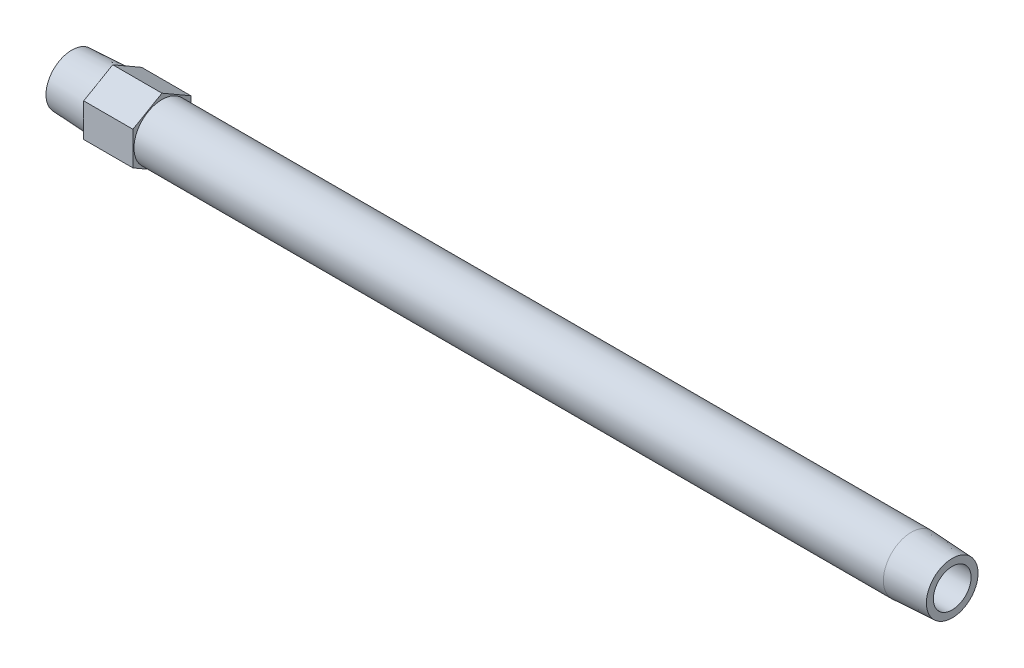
ISO-10303-21;
HEADER;
FILE_DESCRIPTION(('STEP AP214'),'2;1');
FILE_NAME('part.step','',(''),(''),'','','');
FILE_SCHEMA(('AUTOMOTIVE_DESIGN { 1 0 10303 214 1 1 1 1 }'));
ENDSEC;
DATA;
#1=APPLICATION_CONTEXT('core data for automotive mechanical design processes');
#2=APPLICATION_PROTOCOL_DEFINITION('international standard','automotive_design',2000,#1);
#3=PRODUCT_CONTEXT('',#1,'mechanical');
#4=PRODUCT('Part','Part','',(#3));
#5=PRODUCT_RELATED_PRODUCT_CATEGORY('part','',(#4));
#6=PRODUCT_DEFINITION_FORMATION('','',#4);
#7=PRODUCT_DEFINITION_CONTEXT('part definition',#1,'design');
#8=PRODUCT_DEFINITION('design','',#6,#7);
#9=PRODUCT_DEFINITION_SHAPE('','',#8);
#10=(LENGTH_UNIT() NAMED_UNIT(*) SI_UNIT(.MILLI.,.METRE.));
#11=(NAMED_UNIT(*) PLANE_ANGLE_UNIT() SI_UNIT($,.RADIAN.));
#12=(NAMED_UNIT(*) SI_UNIT($,.STERADIAN.) SOLID_ANGLE_UNIT());
#13=UNCERTAINTY_MEASURE_WITH_UNIT(LENGTH_MEASURE(1.E-05),#10,'distance_accuracy_value','');
#14=(GEOMETRIC_REPRESENTATION_CONTEXT(3) GLOBAL_UNCERTAINTY_ASSIGNED_CONTEXT((#13)) GLOBAL_UNIT_ASSIGNED_CONTEXT((#10,
#11,#12)) REPRESENTATION_CONTEXT('',''));
#15=CARTESIAN_POINT('',(0.,0.,0.));
#16=DIRECTION('',(0.,0.,1.));
#17=DIRECTION('',(1.,0.,0.));
#18=AXIS2_PLACEMENT_3D('',#15,#16,#17);
#19=CARTESIAN_POINT('',(0.,0.,-6.3321927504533));
#20=DIRECTION('',(1.,0.,0.));
#21=DIRECTION('',(0.,0.,-1.));
#22=AXIS2_PLACEMENT_3D('',#19,#20,#21);
#23=PLANE('',#22);
#24=CARTESIAN_POINT('',(0.,0.,0.));
#25=DIRECTION('',(-1.,0.,0.));
#26=DIRECTION('',(0.,0.,1.));
#27=AXIS2_PLACEMENT_3D('',#24,#25,#26);
#28=CIRCLE('',#27,6.3321927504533);
#29=CARTESIAN_POINT('',(0.,0.,6.3321927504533));
#30=VERTEX_POINT('',#29);
#31=EDGE_CURVE('E147',#30,#30,#28,.T.);
#32=ORIENTED_EDGE('',*,*,#31,.T.);
#33=EDGE_LOOP('',(#32));
#34=FACE_BOUND('',#33,.T.);
#35=CARTESIAN_POINT('',(0.,0.,0.));
#36=DIRECTION('',(1.,0.,0.));
#37=DIRECTION('',(0.,0.,1.));
#38=AXIS2_PLACEMENT_3D('',#35,#36,#37);
#39=CIRCLE('',#38,4.6228);
#40=CARTESIAN_POINT('',(0.,0.,4.6228));
#41=VERTEX_POINT('',#40);
#42=EDGE_CURVE('E159',#41,#41,#39,.T.);
#43=ORIENTED_EDGE('',*,*,#42,.T.);
#44=EDGE_LOOP('',(#43));
#45=FACE_BOUND('',#44,.T.);
#46=ADVANCED_FACE('F15',(#34,#45),#23,.F.);
#47=CARTESIAN_POINT('',(215.9,0.,-6.33219275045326));
#48=DIRECTION('',(-1.,0.,0.));
#49=DIRECTION('',(0.,0.,1.));
#50=AXIS2_PLACEMENT_3D('',#47,#48,#49);
#51=PLANE('',#50);
#52=CARTESIAN_POINT('',(215.9,0.,0.));
#53=DIRECTION('',(-1.,0.,0.));
#54=DIRECTION('',(0.,0.,1.));
#55=AXIS2_PLACEMENT_3D('',#52,#53,#54);
#56=CIRCLE('',#55,6.33219275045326);
#57=CARTESIAN_POINT('',(215.9,0.,6.33219275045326));
#58=VERTEX_POINT('',#57);
#59=EDGE_CURVE('E150',#58,#58,#56,.T.);
#60=ORIENTED_EDGE('',*,*,#59,.F.);
#61=EDGE_LOOP('',(#60));
#62=FACE_BOUND('',#61,.T.);
#63=CARTESIAN_POINT('',(215.9,0.,0.));
#64=DIRECTION('',(-1.,0.,0.));
#65=DIRECTION('',(0.,0.,1.));
#66=AXIS2_PLACEMENT_3D('',#63,#64,#65);
#67=CIRCLE('',#66,4.6228);
#68=CARTESIAN_POINT('',(215.9,0.,4.6228));
#69=VERTEX_POINT('',#68);
#70=EDGE_CURVE('E156',#69,#69,#67,.F.);
#71=ORIENTED_EDGE('',*,*,#70,.F.);
#72=EDGE_LOOP('',(#71));
#73=FACE_BOUND('',#72,.T.);
#74=ADVANCED_FACE('F178',(#62,#73),#51,.F.);
#75=CARTESIAN_POINT('',(22.098,-12.3183453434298,7.112));
#76=DIRECTION('',(-1.,0.,0.));
#77=DIRECTION('',(0.,-1.,0.));
#78=AXIS2_PLACEMENT_3D('',#75,#76,#77);
#79=PLANE('',#78);
#80=DIRECTION('',(0.,0.5,-0.866025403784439));
#81=VECTOR('',#80,1.);
#82=CARTESIAN_POINT('',(22.098,-8.21223022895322,0.));
#83=LINE('',#82,#81);
#84=CARTESIAN_POINT('',(22.098,-8.21223022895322,0.));
#85=VERTEX_POINT('',#84);
#86=CARTESIAN_POINT('',(22.098,-4.10611511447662,-7.112));
#87=VERTEX_POINT('',#86);
#88=EDGE_CURVE('E103',#85,#87,#83,.T.);
#89=ORIENTED_EDGE('',*,*,#88,.T.);
#90=DIRECTION('',(0.,1.,0.));
#91=VECTOR('',#90,1.);
#92=CARTESIAN_POINT('',(22.098,-4.10611511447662,-7.112));
#93=LINE('',#92,#91);
#94=CARTESIAN_POINT('',(22.098,4.10611511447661,-7.112));
#95=VERTEX_POINT('',#94);
#96=EDGE_CURVE('E83',#87,#95,#93,.T.);
#97=ORIENTED_EDGE('',*,*,#96,.T.);
#98=DIRECTION('',(0.,0.5,0.866025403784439));
#99=VECTOR('',#98,1.);
#100=CARTESIAN_POINT('',(22.098,4.10611511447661,-7.112));
#101=LINE('',#100,#99);
#102=CARTESIAN_POINT('',(22.098,8.21223022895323,0.));
#103=VERTEX_POINT('',#102);
#104=EDGE_CURVE('E102',#95,#103,#101,.T.);
#105=ORIENTED_EDGE('',*,*,#104,.T.);
#106=DIRECTION('',(0.,-0.5,0.866025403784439));
#107=VECTOR('',#106,1.);
#108=CARTESIAN_POINT('',(22.098,8.21223022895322,0.));
#109=LINE('',#108,#107);
#110=CARTESIAN_POINT('',(22.098,4.10611511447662,7.112));
#111=VERTEX_POINT('',#110);
#112=EDGE_CURVE('E105',#103,#111,#109,.T.);
#113=ORIENTED_EDGE('',*,*,#112,.T.);
#114=DIRECTION('',(0.,-1.,0.));
#115=VECTOR('',#114,1.);
#116=CARTESIAN_POINT('',(22.098,4.10611511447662,7.112));
#117=LINE('',#116,#115);
#118=CARTESIAN_POINT('',(22.098,-4.10611511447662,7.112));
#119=VERTEX_POINT('',#118);
#120=EDGE_CURVE('E35',#111,#119,#117,.T.);
#121=ORIENTED_EDGE('',*,*,#120,.T.);
#122=DIRECTION('',(0.,-0.5,-0.866025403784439));
#123=VECTOR('',#122,1.);
#124=CARTESIAN_POINT('',(22.098,-4.10611511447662,7.112));
#125=LINE('',#124,#123);
#126=EDGE_CURVE('E30',#119,#85,#125,.T.);
#127=ORIENTED_EDGE('',*,*,#126,.T.);
#128=EDGE_LOOP('',(#89,#97,#105,#113,#121,#127));
#129=FACE_BOUND('',#128,.T.);
#130=CARTESIAN_POINT('',(22.098,0.,0.));
#131=DIRECTION('',(-1.,0.,0.));
#132=DIRECTION('',(0.,-1.,0.));
#133=AXIS2_PLACEMENT_3D('',#130,#131,#132);
#134=CIRCLE('',#133,6.858);
#135=CARTESIAN_POINT('',(22.098,-6.858,0.));
#136=VERTEX_POINT('',#135);
#137=EDGE_CURVE('E89',#136,#136,#134,.F.);
#138=ORIENTED_EDGE('',*,*,#137,.F.);
#139=EDGE_LOOP('',(#138));
#140=FACE_BOUND('',#139,.T.);
#141=ADVANCED_FACE('F124',(#129,#140),#79,.F.);
#142=CARTESIAN_POINT('',(10.033,-12.3183453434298,7.112));
#143=DIRECTION('',(-1.,0.,0.));
#144=DIRECTION('',(0.,-1.,0.));
#145=AXIS2_PLACEMENT_3D('',#142,#143,#144);
#146=PLANE('',#145);
#147=DIRECTION('',(0.,0.5,-0.866025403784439));
#148=VECTOR('',#147,1.);
#149=CARTESIAN_POINT('',(10.033,-8.21223022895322,0.));
#150=LINE('',#149,#148);
#151=CARTESIAN_POINT('',(10.033,-8.21223022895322,0.));
#152=VERTEX_POINT('',#151);
#153=CARTESIAN_POINT('',(10.033,-4.10611511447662,-7.112));
#154=VERTEX_POINT('',#153);
#155=EDGE_CURVE('E73',#152,#154,#150,.T.);
#156=ORIENTED_EDGE('',*,*,#155,.F.);
#157=DIRECTION('',(0.,-0.5,-0.866025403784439));
#158=VECTOR('',#157,1.);
#159=CARTESIAN_POINT('',(10.033,-4.10611511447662,7.112));
#160=LINE('',#159,#158);
#161=CARTESIAN_POINT('',(10.033,-4.10611511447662,7.112));
#162=VERTEX_POINT('',#161);
#163=EDGE_CURVE('E99',#162,#152,#160,.T.);
#164=ORIENTED_EDGE('',*,*,#163,.F.);
#165=DIRECTION('',(0.,-1.,0.));
#166=VECTOR('',#165,1.);
#167=CARTESIAN_POINT('',(10.033,4.10611511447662,7.112));
#168=LINE('',#167,#166);
#169=CARTESIAN_POINT('',(10.033,4.10611511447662,7.112));
#170=VERTEX_POINT('',#169);
#171=EDGE_CURVE('E133',#170,#162,#168,.T.);
#172=ORIENTED_EDGE('',*,*,#171,.F.);
#173=DIRECTION('',(0.,-0.5,0.866025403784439));
#174=VECTOR('',#173,1.);
#175=CARTESIAN_POINT('',(10.033,8.21223022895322,0.));
#176=LINE('',#175,#174);
#177=CARTESIAN_POINT('',(10.033,8.21223022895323,0.));
#178=VERTEX_POINT('',#177);
#179=EDGE_CURVE('E129',#178,#170,#176,.T.);
#180=ORIENTED_EDGE('',*,*,#179,.F.);
#181=DIRECTION('',(0.,0.5,0.866025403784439));
#182=VECTOR('',#181,1.);
#183=CARTESIAN_POINT('',(10.033,4.10611511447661,-7.112));
#184=LINE('',#183,#182);
#185=CARTESIAN_POINT('',(10.033,4.10611511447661,-7.112));
#186=VERTEX_POINT('',#185);
#187=EDGE_CURVE('E75',#186,#178,#184,.T.);
#188=ORIENTED_EDGE('',*,*,#187,.F.);
#189=DIRECTION('',(0.,1.,0.));
#190=VECTOR('',#189,1.);
#191=CARTESIAN_POINT('',(10.033,-4.10611511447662,-7.112));
#192=LINE('',#191,#190);
#193=EDGE_CURVE('E68',#154,#186,#192,.T.);
#194=ORIENTED_EDGE('',*,*,#193,.F.);
#195=EDGE_LOOP('',(#156,#164,#172,#180,#188,#194));
#196=FACE_BOUND('',#195,.T.);
#197=CARTESIAN_POINT('',(10.033,0.,0.));
#198=DIRECTION('',(-1.,0.,0.));
#199=DIRECTION('',(0.,0.,1.));
#200=AXIS2_PLACEMENT_3D('',#197,#198,#199);
#201=CIRCLE('',#200,6.858);
#202=CARTESIAN_POINT('',(10.033,0.,6.858));
#203=VERTEX_POINT('',#202);
#204=EDGE_CURVE('E95',#203,#203,#201,.T.);
#205=ORIENTED_EDGE('',*,*,#204,.F.);
#206=EDGE_LOOP('',(#205));
#207=FACE_BOUND('',#206,.T.);
#208=ADVANCED_FACE('F69',(#196,#207),#146,.T.);
#209=CARTESIAN_POINT('',(22.098,-8.21223022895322,0.));
#210=DIRECTION('',(0.,0.866025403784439,0.5));
#211=DIRECTION('',(0.,-0.5,0.866025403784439));
#212=AXIS2_PLACEMENT_3D('',#209,#210,#211);
#213=PLANE('',#212);
#214=ORIENTED_EDGE('',*,*,#155,.T.);
#215=DIRECTION('',(-1.,0.,0.));
#216=VECTOR('',#215,1.);
#217=CARTESIAN_POINT('',(22.098,-4.10611511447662,-7.112));
#218=LINE('',#217,#216);
#219=EDGE_CURVE('E10',#87,#154,#218,.T.);
#220=ORIENTED_EDGE('',*,*,#219,.F.);
#221=ORIENTED_EDGE('',*,*,#88,.F.);
#222=DIRECTION('',(-1.,0.,0.));
#223=VECTOR('',#222,1.);
#224=CARTESIAN_POINT('',(22.098,-8.21223022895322,0.));
#225=LINE('',#224,#223);
#226=EDGE_CURVE('E87',#85,#152,#225,.T.);
#227=ORIENTED_EDGE('',*,*,#226,.T.);
#228=EDGE_LOOP('',(#214,#220,#221,#227));
#229=FACE_BOUND('',#228,.T.);
#230=ADVANCED_FACE('F17',(#229),#213,.F.);
#231=CARTESIAN_POINT('',(22.098,-4.10611511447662,-7.112));
#232=DIRECTION('',(0.,0.,1.));
#233=DIRECTION('',(0.,-1.,0.));
#234=AXIS2_PLACEMENT_3D('',#231,#232,#233);
#235=PLANE('',#234);
#236=ORIENTED_EDGE('',*,*,#193,.T.);
#237=DIRECTION('',(-1.,0.,0.));
#238=VECTOR('',#237,1.);
#239=CARTESIAN_POINT('',(22.098,4.10611511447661,-7.112));
#240=LINE('',#239,#238);
#241=EDGE_CURVE('E23',#95,#186,#240,.T.);
#242=ORIENTED_EDGE('',*,*,#241,.F.);
#243=ORIENTED_EDGE('',*,*,#96,.F.);
#244=ORIENTED_EDGE('',*,*,#219,.T.);
#245=EDGE_LOOP('',(#236,#242,#243,#244));
#246=FACE_BOUND('',#245,.T.);
#247=ADVANCED_FACE('F82',(#246),#235,.F.);
#248=CARTESIAN_POINT('',(22.098,4.10611511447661,-7.112));
#249=DIRECTION('',(0.,-0.866025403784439,0.5));
#250=DIRECTION('',(0.,-0.5,-0.866025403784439));
#251=AXIS2_PLACEMENT_3D('',#248,#249,#250);
#252=PLANE('',#251);
#253=ORIENTED_EDGE('',*,*,#187,.T.);
#254=DIRECTION('',(-1.,0.,0.));
#255=VECTOR('',#254,1.);
#256=CARTESIAN_POINT('',(22.098,8.21223022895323,0.));
#257=LINE('',#256,#255);
#258=EDGE_CURVE('E117',#103,#178,#257,.T.);
#259=ORIENTED_EDGE('',*,*,#258,.F.);
#260=ORIENTED_EDGE('',*,*,#104,.F.);
#261=ORIENTED_EDGE('',*,*,#241,.T.);
#262=EDGE_LOOP('',(#253,#259,#260,#261));
#263=FACE_BOUND('',#262,.T.);
#264=ADVANCED_FACE('F121',(#263),#252,.F.);
#265=CARTESIAN_POINT('',(22.098,8.21223022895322,0.));
#266=DIRECTION('',(0.,-0.866025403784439,-0.5));
#267=DIRECTION('',(0.,0.5,-0.866025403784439));
#268=AXIS2_PLACEMENT_3D('',#265,#266,#267);
#269=PLANE('',#268);
#270=ORIENTED_EDGE('',*,*,#179,.T.);
#271=DIRECTION('',(-1.,0.,0.));
#272=VECTOR('',#271,1.);
#273=CARTESIAN_POINT('',(22.098,4.10611511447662,7.112));
#274=LINE('',#273,#272);
#275=EDGE_CURVE('E114',#111,#170,#274,.T.);
#276=ORIENTED_EDGE('',*,*,#275,.F.);
#277=ORIENTED_EDGE('',*,*,#112,.F.);
#278=ORIENTED_EDGE('',*,*,#258,.T.);
#279=EDGE_LOOP('',(#270,#276,#277,#278));
#280=FACE_BOUND('',#279,.T.);
#281=ADVANCED_FACE('F128',(#280),#269,.F.);
#282=CARTESIAN_POINT('',(22.098,4.10611511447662,7.112));
#283=DIRECTION('',(0.,0.,-1.));
#284=DIRECTION('',(-1.,0.,0.));
#285=AXIS2_PLACEMENT_3D('',#282,#283,#284);
#286=PLANE('',#285);
#287=ORIENTED_EDGE('',*,*,#171,.T.);
#288=DIRECTION('',(-1.,0.,0.));
#289=VECTOR('',#288,1.);
#290=CARTESIAN_POINT('',(22.098,-4.10611511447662,7.112));
#291=LINE('',#290,#289);
#292=EDGE_CURVE('E111',#119,#162,#291,.T.);
#293=ORIENTED_EDGE('',*,*,#292,.F.);
#294=ORIENTED_EDGE('',*,*,#120,.F.);
#295=ORIENTED_EDGE('',*,*,#275,.T.);
#296=EDGE_LOOP('',(#287,#293,#294,#295));
#297=FACE_BOUND('',#296,.T.);
#298=ADVANCED_FACE('F132',(#297),#286,.F.);
#299=CARTESIAN_POINT('',(22.098,-4.10611511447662,7.112));
#300=DIRECTION('',(0.,0.866025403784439,-0.5));
#301=DIRECTION('',(0.,0.5,0.866025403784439));
#302=AXIS2_PLACEMENT_3D('',#299,#300,#301);
#303=PLANE('',#302);
#304=ORIENTED_EDGE('',*,*,#163,.T.);
#305=ORIENTED_EDGE('',*,*,#226,.F.);
#306=ORIENTED_EDGE('',*,*,#126,.F.);
#307=ORIENTED_EDGE('',*,*,#292,.T.);
#308=EDGE_LOOP('',(#304,#305,#306,#307));
#309=FACE_BOUND('',#308,.T.);
#310=ADVANCED_FACE('F135',(#309),#303,.F.);
#311=CARTESIAN_POINT('',(10.033,0.,0.));
#312=DIRECTION('',(1.,0.,0.));
#313=DIRECTION('',(0.,0.,-1.));
#314=AXIS2_PLACEMENT_3D('',#311,#312,#313);
#315=CONICAL_SURFACE('',#314,6.858,0.0523598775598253);
#316=ORIENTED_EDGE('',*,*,#31,.F.);
#317=EDGE_LOOP('',(#316));
#318=FACE_BOUND('',#317,.T.);
#319=ORIENTED_EDGE('',*,*,#204,.T.);
#320=EDGE_LOOP('',(#319));
#321=FACE_BOUND('',#320,.T.);
#322=ADVANCED_FACE('F187',(#318,#321),#315,.T.);
#323=CARTESIAN_POINT('',(-60.,0.,0.));
#324=DIRECTION('',(-1.,0.,0.));
#325=DIRECTION('',(0.,0.,1.));
#326=AXIS2_PLACEMENT_3D('',#323,#324,#325);
#327=CYLINDRICAL_SURFACE('',#326,6.858);
#328=ORIENTED_EDGE('',*,*,#137,.T.);
#329=EDGE_LOOP('',(#328));
#330=FACE_BOUND('',#329,.T.);
#331=CARTESIAN_POINT('',(205.867,0.,0.));
#332=DIRECTION('',(-1.,0.,0.));
#333=DIRECTION('',(0.,0.,1.));
#334=AXIS2_PLACEMENT_3D('',#331,#332,#333);
#335=CIRCLE('',#334,6.858);
#336=CARTESIAN_POINT('',(205.867,0.,6.858));
#337=VERTEX_POINT('',#336);
#338=EDGE_CURVE('E153',#337,#337,#335,.T.);
#339=ORIENTED_EDGE('',*,*,#338,.T.);
#340=EDGE_LOOP('',(#339));
#341=FACE_BOUND('',#340,.T.);
#342=ADVANCED_FACE('F174',(#330,#341),#327,.T.);
#343=CARTESIAN_POINT('',(215.9,0.,0.));
#344=DIRECTION('',(-1.,0.,0.));
#345=DIRECTION('',(0.,0.,1.));
#346=AXIS2_PLACEMENT_3D('',#343,#344,#345);
#347=CONICAL_SURFACE('',#346,6.33219275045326,0.0523598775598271);
#348=ORIENTED_EDGE('',*,*,#338,.F.);
#349=EDGE_LOOP('',(#348));
#350=FACE_BOUND('',#349,.T.);
#351=ORIENTED_EDGE('',*,*,#59,.T.);
#352=EDGE_LOOP('',(#351));
#353=FACE_BOUND('',#352,.T.);
#354=ADVANCED_FACE('F167',(#350,#353),#347,.T.);
#355=CARTESIAN_POINT('',(216.990541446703,0.,0.));
#356=DIRECTION('',(-1.,0.,0.));
#357=DIRECTION('',(0.,0.,1.));
#358=AXIS2_PLACEMENT_3D('',#355,#356,#357);
#359=CYLINDRICAL_SURFACE('',#358,4.6228);
#360=ORIENTED_EDGE('',*,*,#70,.T.);
#361=EDGE_LOOP('',(#360));
#362=FACE_BOUND('',#361,.T.);
#363=ORIENTED_EDGE('',*,*,#42,.F.);
#364=EDGE_LOOP('',(#363));
#365=FACE_BOUND('',#364,.T.);
#366=ADVANCED_FACE('F165',(#362,#365),#359,.F.);
#367=CLOSED_SHELL('',(#46,#74,#141,#208,#230,#247,#264,#281,#298,#310,#322,#342,#354,#366));
#368=MANIFOLD_SOLID_BREP('B1',#367);
#369=ADVANCED_BREP_SHAPE_REPRESENTATION('',(#18,#368),#14);
#370=SHAPE_DEFINITION_REPRESENTATION(#9,#369);
ENDSEC;
END-ISO-10303-21;
